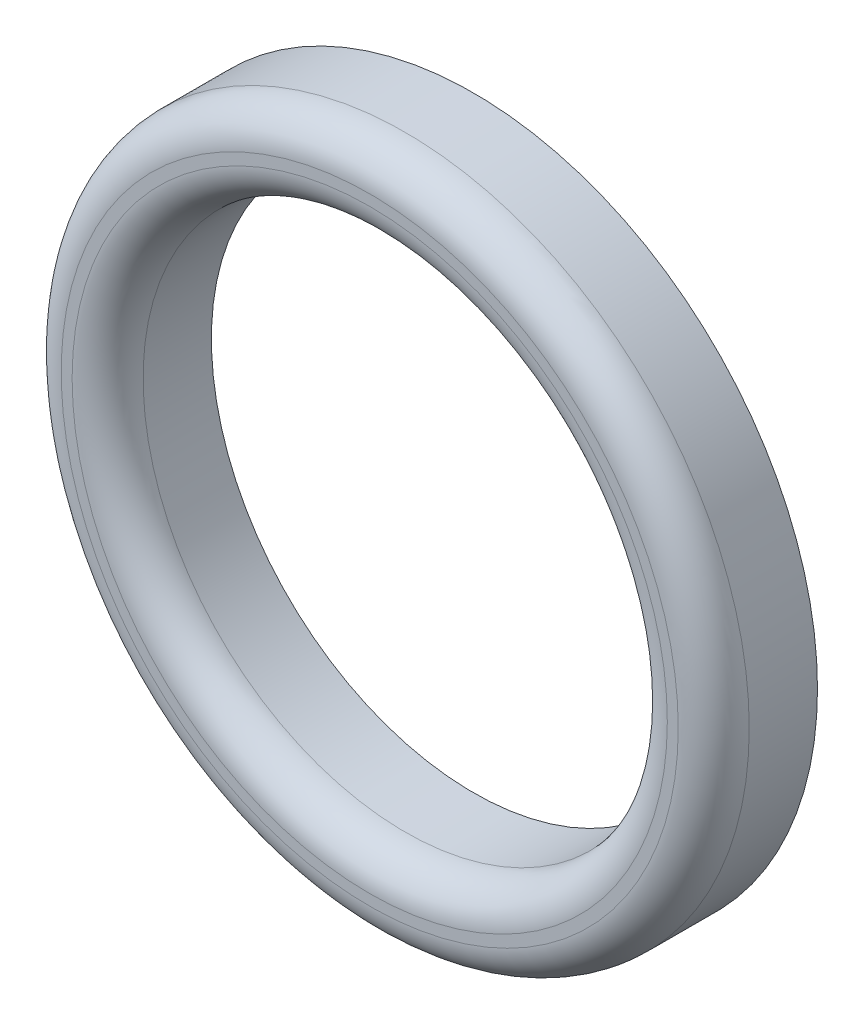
ISO-10303-21;
HEADER;
FILE_DESCRIPTION(('STEP AP214'),'2;1');
FILE_NAME('part.step','',(''),(''),'','','');
FILE_SCHEMA(('AUTOMOTIVE_DESIGN { 1 0 10303 214 1 1 1 1 }'));
ENDSEC;
DATA;
#1=APPLICATION_CONTEXT('core data for automotive mechanical design processes');
#2=APPLICATION_PROTOCOL_DEFINITION('international standard','automotive_design',2000,#1);
#3=PRODUCT_CONTEXT('',#1,'mechanical');
#4=PRODUCT('Part','Part','',(#3));
#5=PRODUCT_RELATED_PRODUCT_CATEGORY('part','',(#4));
#6=PRODUCT_DEFINITION_FORMATION('','',#4);
#7=PRODUCT_DEFINITION_CONTEXT('part definition',#1,'design');
#8=PRODUCT_DEFINITION('design','',#6,#7);
#9=PRODUCT_DEFINITION_SHAPE('','',#8);
#10=(LENGTH_UNIT() NAMED_UNIT(*) SI_UNIT(.MILLI.,.METRE.));
#11=(NAMED_UNIT(*) PLANE_ANGLE_UNIT() SI_UNIT($,.RADIAN.));
#12=(NAMED_UNIT(*) SI_UNIT($,.STERADIAN.) SOLID_ANGLE_UNIT());
#13=UNCERTAINTY_MEASURE_WITH_UNIT(LENGTH_MEASURE(1.E-05),#10,'distance_accuracy_value','');
#14=(GEOMETRIC_REPRESENTATION_CONTEXT(3) GLOBAL_UNCERTAINTY_ASSIGNED_CONTEXT((#13)) GLOBAL_UNIT_ASSIGNED_CONTEXT((#10,
#11,#12)) REPRESENTATION_CONTEXT('',''));
#15=CARTESIAN_POINT('',(0.,0.,0.));
#16=DIRECTION('',(0.,0.,1.));
#17=DIRECTION('',(1.,0.,0.));
#18=AXIS2_PLACEMENT_3D('',#15,#16,#17);
#19=CARTESIAN_POINT('',(0.,0.,4.75));
#20=DIRECTION('',(0.,0.,1.));
#21=DIRECTION('',(1.,0.,0.));
#22=AXIS2_PLACEMENT_3D('',#19,#20,#21);
#23=PLANE('',#22);
#24=CARTESIAN_POINT('',(0.,0.,4.75));
#25=DIRECTION('',(0.,0.,1.));
#26=DIRECTION('',(1.,0.,0.));
#27=AXIS2_PLACEMENT_3D('',#24,#25,#26);
#28=CIRCLE('',#27,14.125);
#29=CARTESIAN_POINT('',(14.125,0.,4.75));
#30=VERTEX_POINT('',#29);
#31=EDGE_CURVE('E50',#30,#30,#28,.T.);
#32=ORIENTED_EDGE('',*,*,#31,.T.);
#33=EDGE_LOOP('',(#32));
#34=FACE_BOUND('',#33,.T.);
#35=CARTESIAN_POINT('',(0.,0.,4.75));
#36=DIRECTION('',(0.,0.,1.));
#37=DIRECTION('',(1.,0.,0.));
#38=AXIS2_PLACEMENT_3D('',#35,#36,#37);
#39=CIRCLE('',#38,13.625);
#40=CARTESIAN_POINT('',(13.625,0.,4.75));
#41=VERTEX_POINT('',#40);
#42=EDGE_CURVE('E55',#41,#41,#39,.F.);
#43=ORIENTED_EDGE('',*,*,#42,.T.);
#44=EDGE_LOOP('',(#43));
#45=FACE_BOUND('',#44,.T.);
#46=ADVANCED_FACE('F37',(#34,#45),#23,.T.);
#47=CARTESIAN_POINT('',(0.,0.,0.));
#48=DIRECTION('',(0.,0.,1.));
#49=DIRECTION('',(1.,0.,0.));
#50=AXIS2_PLACEMENT_3D('',#47,#48,#49);
#51=PLANE('',#50);
#52=CARTESIAN_POINT('',(0.,0.,0.));
#53=DIRECTION('',(0.,0.,1.));
#54=DIRECTION('',(1.,0.,0.));
#55=AXIS2_PLACEMENT_3D('',#52,#53,#54);
#56=CIRCLE('',#55,15.75);
#57=CARTESIAN_POINT('',(15.75,0.,0.));
#58=VERTEX_POINT('',#57);
#59=EDGE_CURVE('E61',#58,#58,#56,.T.);
#60=ORIENTED_EDGE('',*,*,#59,.F.);
#61=EDGE_LOOP('',(#60));
#62=FACE_BOUND('',#61,.T.);
#63=CARTESIAN_POINT('',(0.,0.,0.));
#64=DIRECTION('',(0.,0.,1.));
#65=DIRECTION('',(1.,0.,0.));
#66=AXIS2_PLACEMENT_3D('',#63,#64,#65);
#67=CIRCLE('',#66,12.);
#68=CARTESIAN_POINT('',(12.,0.,0.));
#69=VERTEX_POINT('',#68);
#70=EDGE_CURVE('E65',#69,#69,#67,.T.);
#71=ORIENTED_EDGE('',*,*,#70,.T.);
#72=EDGE_LOOP('',(#71));
#73=FACE_BOUND('',#72,.T.);
#74=ADVANCED_FACE('F70',(#62,#73),#51,.F.);
#75=CARTESIAN_POINT('',(0.,0.,4.75));
#76=DIRECTION('',(0.,0.,-1.));
#77=DIRECTION('',(-1.,0.,0.));
#78=AXIS2_PLACEMENT_3D('',#75,#76,#77);
#79=CYLINDRICAL_SURFACE('',#78,15.75);
#80=CARTESIAN_POINT('',(0.,0.,3.125));
#81=DIRECTION('',(0.,0.,1.));
#82=DIRECTION('',(1.,0.,0.));
#83=AXIS2_PLACEMENT_3D('',#80,#81,#82);
#84=CIRCLE('',#83,15.75);
#85=CARTESIAN_POINT('',(15.75,0.,3.125));
#86=VERTEX_POINT('',#85);
#87=EDGE_CURVE('E45',#86,#86,#84,.F.);
#88=ORIENTED_EDGE('',*,*,#87,.T.);
#89=EDGE_LOOP('',(#88));
#90=FACE_BOUND('',#89,.T.);
#91=ORIENTED_EDGE('',*,*,#59,.T.);
#92=EDGE_LOOP('',(#91));
#93=FACE_BOUND('',#92,.T.);
#94=ADVANCED_FACE('F75',(#90,#93),#79,.T.);
#95=CARTESIAN_POINT('',(0.,0.,4.75));
#96=DIRECTION('',(0.,0.,-1.));
#97=DIRECTION('',(-1.,0.,0.));
#98=AXIS2_PLACEMENT_3D('',#95,#96,#97);
#99=CYLINDRICAL_SURFACE('',#98,12.);
#100=CARTESIAN_POINT('',(0.,0.,3.125));
#101=DIRECTION('',(0.,0.,1.));
#102=DIRECTION('',(1.,0.,0.));
#103=AXIS2_PLACEMENT_3D('',#100,#101,#102);
#104=CIRCLE('',#103,12.);
#105=CARTESIAN_POINT('',(12.,0.,3.125));
#106=VERTEX_POINT('',#105);
#107=EDGE_CURVE('E10',#106,#106,#104,.T.);
#108=ORIENTED_EDGE('',*,*,#107,.T.);
#109=EDGE_LOOP('',(#108));
#110=FACE_BOUND('',#109,.T.);
#111=ORIENTED_EDGE('',*,*,#70,.F.);
#112=EDGE_LOOP('',(#111));
#113=FACE_BOUND('',#112,.T.);
#114=ADVANCED_FACE('F72',(#110,#113),#99,.F.);
#115=CARTESIAN_POINT('',(0.,0.,3.125));
#116=DIRECTION('',(0.,0.,1.));
#117=DIRECTION('',(1.,0.,0.));
#118=AXIS2_PLACEMENT_3D('',#115,#116,#117);
#119=TOROIDAL_SURFACE('',#118,14.125,1.625);
#120=ORIENTED_EDGE('',*,*,#87,.F.);
#121=EDGE_LOOP('',(#120));
#122=FACE_BOUND('',#121,.T.);
#123=ORIENTED_EDGE('',*,*,#31,.F.);
#124=EDGE_LOOP('',(#123));
#125=FACE_BOUND('',#124,.T.);
#126=ADVANCED_FACE('F74',(#122,#125),#119,.T.);
#127=CARTESIAN_POINT('',(0.,0.,3.125));
#128=DIRECTION('',(0.,0.,1.));
#129=DIRECTION('',(1.,0.,0.));
#130=AXIS2_PLACEMENT_3D('',#127,#128,#129);
#131=TOROIDAL_SURFACE('',#130,13.625,1.625);
#132=ORIENTED_EDGE('',*,*,#42,.F.);
#133=EDGE_LOOP('',(#132));
#134=FACE_BOUND('',#133,.T.);
#135=ORIENTED_EDGE('',*,*,#107,.F.);
#136=EDGE_LOOP('',(#135));
#137=FACE_BOUND('',#136,.T.);
#138=ADVANCED_FACE('F39',(#134,#137),#131,.T.);
#139=CLOSED_SHELL('',(#46,#74,#94,#114,#126,#138));
#140=MANIFOLD_SOLID_BREP('B2',#139);
#141=ADVANCED_BREP_SHAPE_REPRESENTATION('',(#18,#140),#14);
#142=SHAPE_DEFINITION_REPRESENTATION(#9,#141);
ENDSEC;
END-ISO-10303-21;
